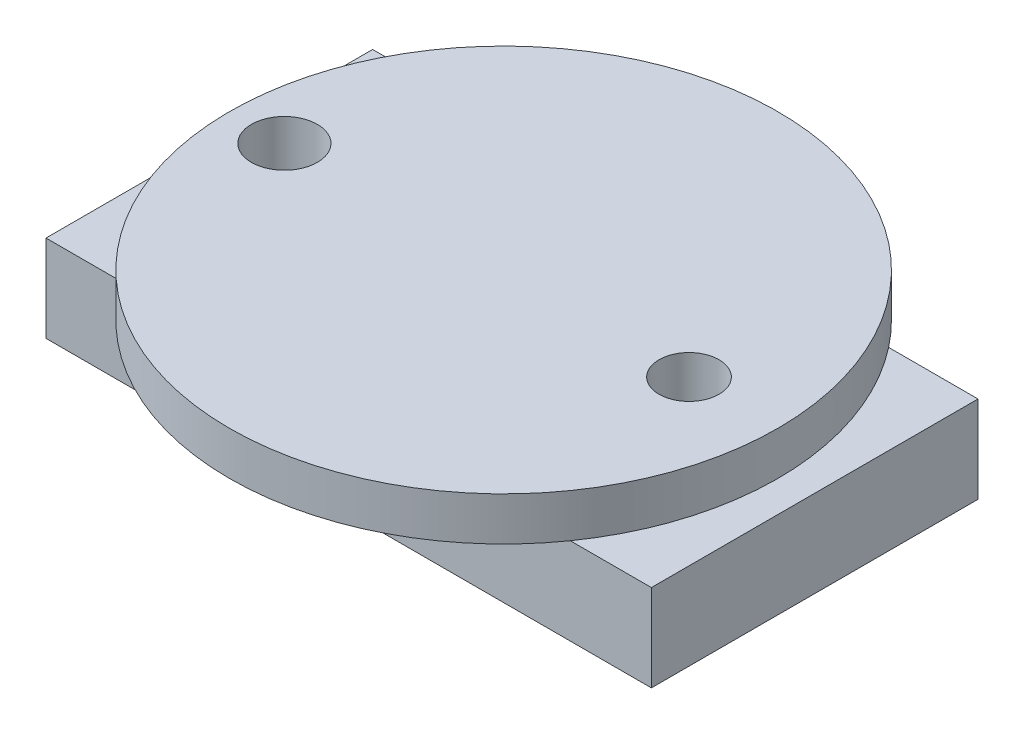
from build123d import *

# Parameters (mm, degrees)
BOSS_EXTRUDE5_DEPTH   = 12.7
SKETCH2_W             = 176.899085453
SKETCH2_H             = 95.44447669
BOSS_EXTRUDE5_2_DEPTH = 12.7
SKETCH3_R             = 80.137093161
SKETCH3_R_2           = 9.632580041
SKETCH3_R_3           = 8.760552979
BOSS_EXTRUDE7_DEPTH   = 12.7
SKETCH7_W             = 176.899085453
SKETCH7_H             = 95.44447669
BOSS_EXTRUDE9_DEPTH   = 12.7


with BuildPart() as part:
    # Sketch2 → Boss-Extrude5 (new body)
    with BuildSketch(Plane(origin=(0, 0, 0), x_dir=(1, 0, 0), z_dir=(0, 1, 0))):
        with BuildLine():
            ThreePointArc((-62.076227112, 5.07328279), (-62.853714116, -0.007660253), (-62.071632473, -5.087898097))
            Line((-62.071632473, -5.087898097), (-69.56194799, -18.024279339))
            Line((-69.56194799, -18.024279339), (-90.359641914, -17.998383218))
            Line((-90.359641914, -17.998383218), (-100.736062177, 0.025896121))
            Line((-100.736062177, 0.025896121), (-90.314788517, 18.024279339))
            Line((-90.314788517, 18.024279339), (-69.517094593, 17.998383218))
            Line((-69.517094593, 17.998383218), (-62.076227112, 5.07328279))
        make_face()
    extrude(amount=BOSS_EXTRUDE5_DEPTH)



with BuildPart() as body_2:
    # Sketch2 → Boss-Extrude5 2 (new body)
    with BuildSketch(Plane(origin=(0, 0, 0), x_dir=(1, 0, 0), z_dir=(0, 1, 0))):
        with Locations((-59.457155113, 1.635878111)):
            Rectangle(SKETCH2_W, SKETCH2_H)
        with BuildLine():
            ThreePointArc((-60.697954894, 8.270046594), (-42.881636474, 16.667490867), (-29.162687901, 2.534949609))
            Line((-29.162687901, 2.534949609), (-14.477026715, 2.534949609))
            ThreePointArc((-14.477026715, 2.534949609), (2.669307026, 0), (-14.477026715, -2.534949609))
            Line((-14.477026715, -2.534949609), (-29.162687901, -2.534949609))
            ThreePointArc((-29.162687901, -2.534949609), (-42.881636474, -16.667490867), (-60.697954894, -8.270046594))
            Line((-60.697954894, -8.270046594), (-67.93080476, -20.797710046))
            Line((-67.93080476, -20.797710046), (-91.945931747, -20.797710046))
            Line((-91.945931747, -20.797710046), (-102.489941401, -2.534949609))
            Line((-102.489941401, -2.534949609), (-115.04313737, -2.534949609))
            ThreePointArc((-115.04313737, -2.534949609), (-133.968759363, 0), (-115.04313737, 2.534949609))
            Line((-115.04313737, 2.534949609), (-102.489941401, 2.534949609))
            Line((-102.489941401, 2.534949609), (-91.945931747, 20.797710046))
            Line((-91.945931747, 20.797710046), (-67.93080476, 20.797710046))
            Line((-67.93080476, 20.797710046), (-60.697954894, 8.270046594))
        make_face(mode=Mode.SUBTRACT)
    extrude(amount=BOSS_EXTRUDE5_2_DEPTH)


with BuildPart() as part_1:
    add(part.part)

    add(body_2.part)  # Boss-Extrude7 merges body 2
    # Sketch3 → Boss-Extrude7 (add)
    with BuildSketch(Plane(origin=(0, 12.7, 0), x_dir=(1, 0, 0), z_dir=(0, 1, 0))):
        with Locations(Location((-60.255548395, 0, 0), (0, 0, 141.981129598))):
            Circle(SKETCH3_R)
        with Locations(Location((-124.336179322, 0, 0), (0, 0, 15.257893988))):
            Circle(SKETCH3_R_2, mode=Mode.SUBTRACT)
        with Locations(Location((-6.091245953, 0, 0), (0, 0, 163.180383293))):
            Circle(SKETCH3_R_3, mode=Mode.SUBTRACT)
    extrude(amount=BOSS_EXTRUDE7_DEPTH)

    # Sketch7 → Boss-Extrude9 (add)
    with BuildSketch(Plane(origin=(0, 0, 0), x_dir=(-1, 0, 0), z_dir=(0, -1, 0))):
        with Locations((59.457155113, 1.635878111)):
            Rectangle(SKETCH7_W, SKETCH7_H)
    extrude(amount=BOSS_EXTRUDE9_DEPTH)


solid = part_1.part
